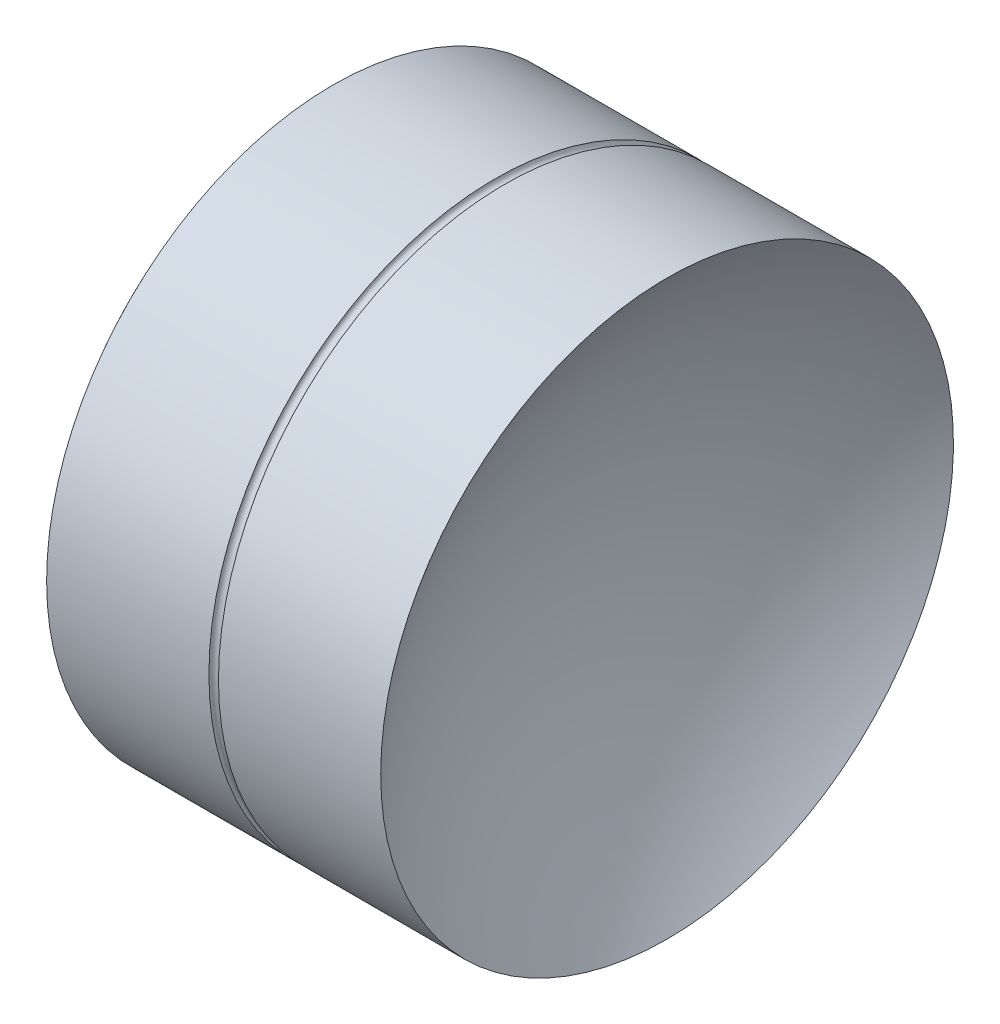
from build123d import *


with BuildPart() as part:
    # Esquisse1 → R_volution1 (revolve)
    with BuildSketch(Plane.XY, mode=Mode.PRIVATE) as r_volution1_sk:
        with BuildLine():
            Line((6.222871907, 0), (9.722871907, 0))
            ThreePointArc((9.722871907, 0), (9.979455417, 1.58113883), (10.722871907, 3))
            Line((10.722871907, 3), (9.022871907, 3))
            ThreePointArc((9.022871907, 3), (8.972871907, 2.95), (8.922871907, 3))
            Line((8.922871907, 3), (7.222871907, 3))
            ThreePointArc((7.222871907, 3), (6.479455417, 1.58113883), (6.222871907, 0))
        make_face()
    revolve(r_volution1_sk.sketch.rotate(Axis((-64.512296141, 0, 0), (1, 0, 0)), 90), axis=Axis((-64.512296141, 0, 0), (1, 0, 0)))


solid = part.part
